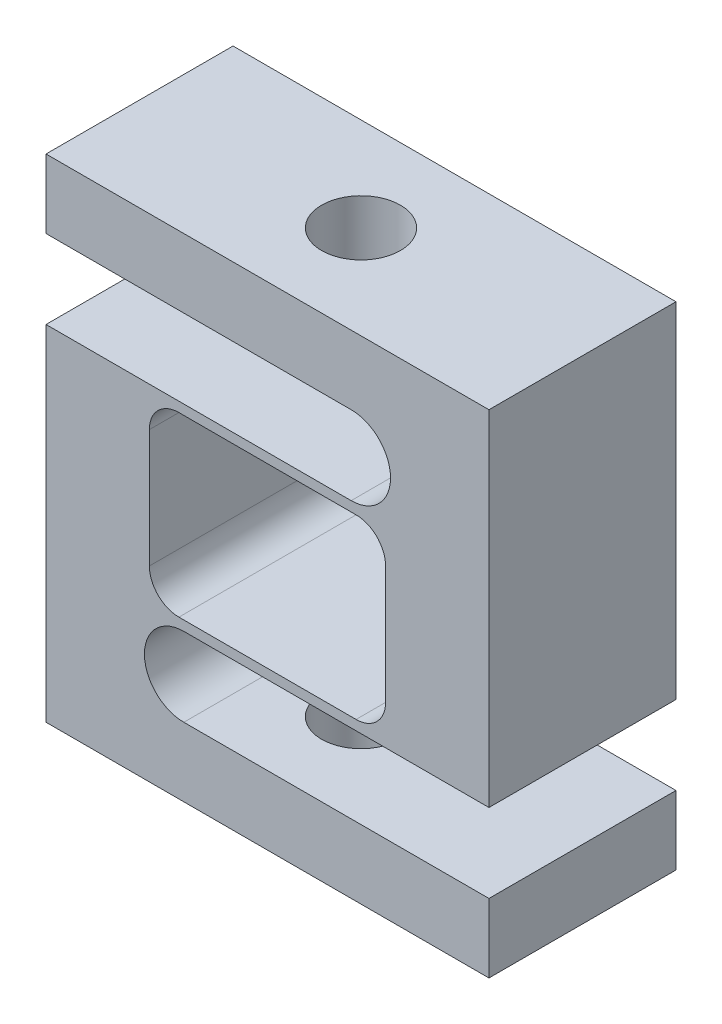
ISO-10303-21;
HEADER;
FILE_DESCRIPTION(('STEP AP214'),'2;1');
FILE_NAME('part.step','',(''),(''),'','','');
FILE_SCHEMA(('AUTOMOTIVE_DESIGN { 1 0 10303 214 1 1 1 1 }'));
ENDSEC;
DATA;
#1=APPLICATION_CONTEXT('core data for automotive mechanical design processes');
#2=APPLICATION_PROTOCOL_DEFINITION('international standard','automotive_design',2000,#1);
#3=PRODUCT_CONTEXT('',#1,'mechanical');
#4=PRODUCT('Part','Part','',(#3));
#5=PRODUCT_RELATED_PRODUCT_CATEGORY('part','',(#4));
#6=PRODUCT_DEFINITION_FORMATION('','',#4);
#7=PRODUCT_DEFINITION_CONTEXT('part definition',#1,'design');
#8=PRODUCT_DEFINITION('design','',#6,#7);
#9=PRODUCT_DEFINITION_SHAPE('','',#8);
#10=(LENGTH_UNIT() NAMED_UNIT(*) SI_UNIT(.MILLI.,.METRE.));
#11=(NAMED_UNIT(*) PLANE_ANGLE_UNIT() SI_UNIT($,.RADIAN.));
#12=(NAMED_UNIT(*) SI_UNIT($,.STERADIAN.) SOLID_ANGLE_UNIT());
#13=UNCERTAINTY_MEASURE_WITH_UNIT(LENGTH_MEASURE(1.E-05),#10,'distance_accuracy_value','');
#14=(GEOMETRIC_REPRESENTATION_CONTEXT(3) GLOBAL_UNCERTAINTY_ASSIGNED_CONTEXT((#13)) GLOBAL_UNIT_ASSIGNED_CONTEXT((#10,
#11,#12)) REPRESENTATION_CONTEXT('',''));
#15=CARTESIAN_POINT('',(0.,0.,0.));
#16=DIRECTION('',(0.,0.,1.));
#17=DIRECTION('',(1.,0.,0.));
#18=AXIS2_PLACEMENT_3D('',#15,#16,#17);
#19=CARTESIAN_POINT('',(8.5,14.,9.5));
#20=DIRECTION('',(0.,0.,-1.));
#21=DIRECTION('',(-1.,0.,0.));
#22=AXIS2_PLACEMENT_3D('',#19,#20,#21);
#23=PLANE('',#22);
#24=DIRECTION('',(0.,-1.,0.));
#25=VECTOR('',#24,1.);
#26=CARTESIAN_POINT('',(-22.5,25.,9.5));
#27=LINE('',#26,#25);
#28=CARTESIAN_POINT('',(-22.5,25.,9.5));
#29=VERTEX_POINT('',#28);
#30=CARTESIAN_POINT('',(-22.5,18.,9.5));
#31=VERTEX_POINT('',#30);
#32=EDGE_CURVE('E189',#29,#31,#27,.T.);
#33=ORIENTED_EDGE('',*,*,#32,.T.);
#34=DIRECTION('',(1.,0.,0.));
#35=VECTOR('',#34,1.);
#36=CARTESIAN_POINT('',(-22.5,18.,9.5));
#37=LINE('',#36,#35);
#38=CARTESIAN_POINT('',(8.5,18.,9.5));
#39=VERTEX_POINT('',#38);
#40=EDGE_CURVE('E178',#31,#39,#37,.T.);
#41=ORIENTED_EDGE('',*,*,#40,.T.);
#42=CARTESIAN_POINT('',(8.5,14.,9.5));
#43=DIRECTION('',(0.,0.,-1.));
#44=DIRECTION('',(-1.,0.,0.));
#45=AXIS2_PLACEMENT_3D('',#42,#43,#44);
#46=CIRCLE('',#45,4.);
#47=CARTESIAN_POINT('',(8.5,10.,9.5));
#48=VERTEX_POINT('',#47);
#49=EDGE_CURVE('E188',#39,#48,#46,.T.);
#50=ORIENTED_EDGE('',*,*,#49,.T.);
#51=DIRECTION('',(-1.,0.,0.));
#52=VECTOR('',#51,1.);
#53=CARTESIAN_POINT('',(8.5,10.,9.5));
#54=LINE('',#53,#52);
#55=CARTESIAN_POINT('',(-22.5,10.,9.5));
#56=VERTEX_POINT('',#55);
#57=EDGE_CURVE('E279',#48,#56,#54,.T.);
#58=ORIENTED_EDGE('',*,*,#57,.T.);
#59=DIRECTION('',(0.,-1.,0.));
#60=VECTOR('',#59,1.);
#61=CARTESIAN_POINT('',(-22.5,10.,9.5));
#62=LINE('',#61,#60);
#63=CARTESIAN_POINT('',(-22.5,-25.,9.5));
#64=VERTEX_POINT('',#63);
#65=EDGE_CURVE('E281',#56,#64,#62,.T.);
#66=ORIENTED_EDGE('',*,*,#65,.T.);
#67=DIRECTION('',(1.,0.,0.));
#68=VECTOR('',#67,1.);
#69=CARTESIAN_POINT('',(-22.5,-25.,9.5));
#70=LINE('',#69,#68);
#71=CARTESIAN_POINT('',(22.5,-25.,9.5));
#72=VERTEX_POINT('',#71);
#73=EDGE_CURVE('E283',#64,#72,#70,.T.);
#74=ORIENTED_EDGE('',*,*,#73,.T.);
#75=DIRECTION('',(0.,1.,0.));
#76=VECTOR('',#75,1.);
#77=CARTESIAN_POINT('',(22.5,-18.,9.5));
#78=LINE('',#77,#76);
#79=CARTESIAN_POINT('',(22.5,-18.,9.5));
#80=VERTEX_POINT('',#79);
#81=EDGE_CURVE('E285',#72,#80,#78,.T.);
#82=ORIENTED_EDGE('',*,*,#81,.T.);
#83=DIRECTION('',(-1.,0.,0.));
#84=VECTOR('',#83,1.);
#85=CARTESIAN_POINT('',(-8.49999999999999,-18.,9.5));
#86=LINE('',#85,#84);
#87=CARTESIAN_POINT('',(-8.49999999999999,-18.,9.5));
#88=VERTEX_POINT('',#87);
#89=EDGE_CURVE('E287',#80,#88,#86,.T.);
#90=ORIENTED_EDGE('',*,*,#89,.T.);
#91=CARTESIAN_POINT('',(-8.49999999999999,-14.,9.5));
#92=DIRECTION('',(0.,0.,-1.));
#93=DIRECTION('',(1.,0.,0.));
#94=AXIS2_PLACEMENT_3D('',#91,#92,#93);
#95=CIRCLE('',#94,4.);
#96=CARTESIAN_POINT('',(-8.49999999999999,-10.,9.5));
#97=VERTEX_POINT('',#96);
#98=EDGE_CURVE('E289',#88,#97,#95,.T.);
#99=ORIENTED_EDGE('',*,*,#98,.T.);
#100=DIRECTION('',(1.,0.,0.));
#101=VECTOR('',#100,1.);
#102=CARTESIAN_POINT('',(22.5,-10.,9.5));
#103=LINE('',#102,#101);
#104=CARTESIAN_POINT('',(22.5,-10.,9.5));
#105=VERTEX_POINT('',#104);
#106=EDGE_CURVE('E291',#97,#105,#103,.T.);
#107=ORIENTED_EDGE('',*,*,#106,.T.);
#108=DIRECTION('',(0.,1.,0.));
#109=VECTOR('',#108,1.);
#110=CARTESIAN_POINT('',(22.5,25.,9.5));
#111=LINE('',#110,#109);
#112=CARTESIAN_POINT('',(22.5,25.,9.5));
#113=VERTEX_POINT('',#112);
#114=EDGE_CURVE('E293',#105,#113,#111,.T.);
#115=ORIENTED_EDGE('',*,*,#114,.T.);
#116=DIRECTION('',(-1.,0.,0.));
#117=VECTOR('',#116,1.);
#118=CARTESIAN_POINT('',(-22.5,25.,9.5));
#119=LINE('',#118,#117);
#120=EDGE_CURVE('E193',#113,#29,#119,.T.);
#121=ORIENTED_EDGE('',*,*,#120,.T.);
#122=EDGE_LOOP('',(#33,#41,#50,#58,#66,#74,#82,#90,#99,#107,#115,#121));
#123=FACE_BOUND('',#122,.T.);
#124=DIRECTION('',(0.,-1.,0.));
#125=VECTOR('',#124,1.);
#126=CARTESIAN_POINT('',(-12.,9.,9.5));
#127=LINE('',#126,#125);
#128=CARTESIAN_POINT('',(-12.,6.,9.5));
#129=VERTEX_POINT('',#128);
#130=CARTESIAN_POINT('',(-12.,-6.,9.5));
#131=VERTEX_POINT('',#130);
#132=EDGE_CURVE('E257',#129,#131,#127,.T.);
#133=ORIENTED_EDGE('',*,*,#132,.F.);
#134=CARTESIAN_POINT('',(-9.,6.,9.5));
#135=DIRECTION('',(0.,0.,-1.));
#136=DIRECTION('',(-1.,0.,0.));
#137=AXIS2_PLACEMENT_3D('',#134,#135,#136);
#138=CIRCLE('',#137,3.);
#139=CARTESIAN_POINT('',(-9.,9.,9.5));
#140=VERTEX_POINT('',#139);
#141=EDGE_CURVE('E228',#129,#140,#138,.T.);
#142=ORIENTED_EDGE('',*,*,#141,.T.);
#143=DIRECTION('',(-1.,0.,0.));
#144=VECTOR('',#143,1.);
#145=CARTESIAN_POINT('',(-12.,9.,9.5));
#146=LINE('',#145,#144);
#147=CARTESIAN_POINT('',(9.,9.,9.5));
#148=VERTEX_POINT('',#147);
#149=EDGE_CURVE('E259',#148,#140,#146,.T.);
#150=ORIENTED_EDGE('',*,*,#149,.F.);
#151=CARTESIAN_POINT('',(9.,6.,9.5));
#152=DIRECTION('',(0.,0.,-1.));
#153=DIRECTION('',(-1.,0.,0.));
#154=AXIS2_PLACEMENT_3D('',#151,#152,#153);
#155=CIRCLE('',#154,3.);
#156=CARTESIAN_POINT('',(12.,6.,9.5));
#157=VERTEX_POINT('',#156);
#158=EDGE_CURVE('E232',#148,#157,#155,.T.);
#159=ORIENTED_EDGE('',*,*,#158,.T.);
#160=DIRECTION('',(0.,1.,0.));
#161=VECTOR('',#160,1.);
#162=CARTESIAN_POINT('',(12.,9.,9.5));
#163=LINE('',#162,#161);
#164=CARTESIAN_POINT('',(12.,-6.,9.5));
#165=VERTEX_POINT('',#164);
#166=EDGE_CURVE('E256',#165,#157,#163,.T.);
#167=ORIENTED_EDGE('',*,*,#166,.F.);
#168=CARTESIAN_POINT('',(9.00000000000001,-6.,9.5));
#169=DIRECTION('',(0.,0.,-1.));
#170=DIRECTION('',(-1.,0.,0.));
#171=AXIS2_PLACEMENT_3D('',#168,#169,#170);
#172=CIRCLE('',#171,3.);
#173=CARTESIAN_POINT('',(9.00000000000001,-9.,9.5));
#174=VERTEX_POINT('',#173);
#175=EDGE_CURVE('E12',#165,#174,#172,.T.);
#176=ORIENTED_EDGE('',*,*,#175,.T.);
#177=DIRECTION('',(1.,0.,0.));
#178=VECTOR('',#177,1.);
#179=CARTESIAN_POINT('',(-12.,-9.,9.5));
#180=LINE('',#179,#178);
#181=CARTESIAN_POINT('',(-9.,-9.,9.5));
#182=VERTEX_POINT('',#181);
#183=EDGE_CURVE('E254',#182,#174,#180,.T.);
#184=ORIENTED_EDGE('',*,*,#183,.F.);
#185=CARTESIAN_POINT('',(-9.,-6.,9.5));
#186=DIRECTION('',(0.,0.,-1.));
#187=DIRECTION('',(-1.,0.,0.));
#188=AXIS2_PLACEMENT_3D('',#185,#186,#187);
#189=CIRCLE('',#188,3.);
#190=EDGE_CURVE('E236',#182,#131,#189,.T.);
#191=ORIENTED_EDGE('',*,*,#190,.T.);
#192=EDGE_LOOP('',(#133,#142,#150,#159,#167,#176,#184,#191));
#193=FACE_BOUND('',#192,.T.);
#194=ADVANCED_FACE('F41',(#123,#193),#23,.F.);
#195=CARTESIAN_POINT('',(8.5,14.,-9.5));
#196=DIRECTION('',(0.,0.,-1.));
#197=DIRECTION('',(-1.,0.,0.));
#198=AXIS2_PLACEMENT_3D('',#195,#196,#197);
#199=PLANE('',#198);
#200=DIRECTION('',(0.,-1.,0.));
#201=VECTOR('',#200,1.);
#202=CARTESIAN_POINT('',(-22.5,25.,-9.5));
#203=LINE('',#202,#201);
#204=CARTESIAN_POINT('',(-22.5,25.,-9.5));
#205=VERTEX_POINT('',#204);
#206=CARTESIAN_POINT('',(-22.5,18.,-9.5));
#207=VERTEX_POINT('',#206);
#208=EDGE_CURVE('E201',#205,#207,#203,.T.);
#209=ORIENTED_EDGE('',*,*,#208,.F.);
#210=DIRECTION('',(-1.,0.,0.));
#211=VECTOR('',#210,1.);
#212=CARTESIAN_POINT('',(-22.5,25.,-9.5));
#213=LINE('',#212,#211);
#214=CARTESIAN_POINT('',(22.5,25.,-9.5));
#215=VERTEX_POINT('',#214);
#216=EDGE_CURVE('E198',#215,#205,#213,.T.);
#217=ORIENTED_EDGE('',*,*,#216,.F.);
#218=DIRECTION('',(0.,1.,0.));
#219=VECTOR('',#218,1.);
#220=CARTESIAN_POINT('',(22.5,25.,-9.5));
#221=LINE('',#220,#219);
#222=CARTESIAN_POINT('',(22.5,-10.,-9.5));
#223=VERTEX_POINT('',#222);
#224=EDGE_CURVE('E316',#223,#215,#221,.T.);
#225=ORIENTED_EDGE('',*,*,#224,.F.);
#226=DIRECTION('',(1.,0.,0.));
#227=VECTOR('',#226,1.);
#228=CARTESIAN_POINT('',(22.5,-10.,-9.5));
#229=LINE('',#228,#227);
#230=CARTESIAN_POINT('',(-8.49999999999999,-10.,-9.5));
#231=VERTEX_POINT('',#230);
#232=EDGE_CURVE('E314',#231,#223,#229,.T.);
#233=ORIENTED_EDGE('',*,*,#232,.F.);
#234=CARTESIAN_POINT('',(-8.49999999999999,-14.,-9.5));
#235=DIRECTION('',(0.,0.,-1.));
#236=DIRECTION('',(1.,0.,0.));
#237=AXIS2_PLACEMENT_3D('',#234,#235,#236);
#238=CIRCLE('',#237,4.);
#239=CARTESIAN_POINT('',(-8.49999999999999,-18.,-9.5));
#240=VERTEX_POINT('',#239);
#241=EDGE_CURVE('E312',#240,#231,#238,.T.);
#242=ORIENTED_EDGE('',*,*,#241,.F.);
#243=DIRECTION('',(-1.,0.,0.));
#244=VECTOR('',#243,1.);
#245=CARTESIAN_POINT('',(-8.49999999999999,-18.,-9.5));
#246=LINE('',#245,#244);
#247=CARTESIAN_POINT('',(22.5,-18.,-9.5));
#248=VERTEX_POINT('',#247);
#249=EDGE_CURVE('E310',#248,#240,#246,.T.);
#250=ORIENTED_EDGE('',*,*,#249,.F.);
#251=DIRECTION('',(0.,1.,0.));
#252=VECTOR('',#251,1.);
#253=CARTESIAN_POINT('',(22.5,-18.,-9.5));
#254=LINE('',#253,#252);
#255=CARTESIAN_POINT('',(22.5,-25.,-9.5));
#256=VERTEX_POINT('',#255);
#257=EDGE_CURVE('E308',#256,#248,#254,.T.);
#258=ORIENTED_EDGE('',*,*,#257,.F.);
#259=DIRECTION('',(1.,0.,0.));
#260=VECTOR('',#259,1.);
#261=CARTESIAN_POINT('',(-22.5,-25.,-9.5));
#262=LINE('',#261,#260);
#263=CARTESIAN_POINT('',(-22.5,-25.,-9.5));
#264=VERTEX_POINT('',#263);
#265=EDGE_CURVE('E306',#264,#256,#262,.T.);
#266=ORIENTED_EDGE('',*,*,#265,.F.);
#267=DIRECTION('',(0.,-1.,0.));
#268=VECTOR('',#267,1.);
#269=CARTESIAN_POINT('',(-22.5,10.,-9.5));
#270=LINE('',#269,#268);
#271=CARTESIAN_POINT('',(-22.5,10.,-9.5));
#272=VERTEX_POINT('',#271);
#273=EDGE_CURVE('E304',#272,#264,#270,.T.);
#274=ORIENTED_EDGE('',*,*,#273,.F.);
#275=DIRECTION('',(-1.,0.,0.));
#276=VECTOR('',#275,1.);
#277=CARTESIAN_POINT('',(8.5,10.,-9.5));
#278=LINE('',#277,#276);
#279=CARTESIAN_POINT('',(8.5,10.,-9.5));
#280=VERTEX_POINT('',#279);
#281=EDGE_CURVE('E302',#280,#272,#278,.T.);
#282=ORIENTED_EDGE('',*,*,#281,.F.);
#283=CARTESIAN_POINT('',(8.5,14.,-9.5));
#284=DIRECTION('',(0.,0.,-1.));
#285=DIRECTION('',(-1.,0.,0.));
#286=AXIS2_PLACEMENT_3D('',#283,#284,#285);
#287=CIRCLE('',#286,4.);
#288=CARTESIAN_POINT('',(8.5,18.,-9.5));
#289=VERTEX_POINT('',#288);
#290=EDGE_CURVE('E300',#289,#280,#287,.T.);
#291=ORIENTED_EDGE('',*,*,#290,.F.);
#292=DIRECTION('',(1.,0.,0.));
#293=VECTOR('',#292,1.);
#294=CARTESIAN_POINT('',(-22.5,18.,-9.5));
#295=LINE('',#294,#293);
#296=EDGE_CURVE('E298',#207,#289,#295,.T.);
#297=ORIENTED_EDGE('',*,*,#296,.F.);
#298=EDGE_LOOP('',(#209,#217,#225,#233,#242,#250,#258,#266,#274,#282,#291,#297));
#299=FACE_BOUND('',#298,.T.);
#300=DIRECTION('',(0.,1.,0.));
#301=VECTOR('',#300,1.);
#302=CARTESIAN_POINT('',(12.,9.,-9.5));
#303=LINE('',#302,#301);
#304=CARTESIAN_POINT('',(12.,-6.,-9.5));
#305=VERTEX_POINT('',#304);
#306=CARTESIAN_POINT('',(12.,6.,-9.5));
#307=VERTEX_POINT('',#306);
#308=EDGE_CURVE('E242',#305,#307,#303,.T.);
#309=ORIENTED_EDGE('',*,*,#308,.T.);
#310=CARTESIAN_POINT('',(9.,6.,-9.5));
#311=DIRECTION('',(0.,0.,-1.));
#312=DIRECTION('',(-1.,0.,0.));
#313=AXIS2_PLACEMENT_3D('',#310,#311,#312);
#314=CIRCLE('',#313,3.);
#315=CARTESIAN_POINT('',(9.,9.,-9.5));
#316=VERTEX_POINT('',#315);
#317=EDGE_CURVE('E230',#307,#316,#314,.F.);
#318=ORIENTED_EDGE('',*,*,#317,.T.);
#319=DIRECTION('',(-1.,0.,0.));
#320=VECTOR('',#319,1.);
#321=CARTESIAN_POINT('',(-12.,9.,-9.5));
#322=LINE('',#321,#320);
#323=CARTESIAN_POINT('',(-9.,9.,-9.5));
#324=VERTEX_POINT('',#323);
#325=EDGE_CURVE('E251',#316,#324,#322,.T.);
#326=ORIENTED_EDGE('',*,*,#325,.T.);
#327=CARTESIAN_POINT('',(-9.,6.,-9.5));
#328=DIRECTION('',(0.,0.,-1.));
#329=DIRECTION('',(-1.,0.,0.));
#330=AXIS2_PLACEMENT_3D('',#327,#328,#329);
#331=CIRCLE('',#330,3.);
#332=CARTESIAN_POINT('',(-12.,6.,-9.5));
#333=VERTEX_POINT('',#332);
#334=EDGE_CURVE('E226',#324,#333,#331,.F.);
#335=ORIENTED_EDGE('',*,*,#334,.T.);
#336=DIRECTION('',(0.,-1.,0.));
#337=VECTOR('',#336,1.);
#338=CARTESIAN_POINT('',(-12.,9.,-9.5));
#339=LINE('',#338,#337);
#340=CARTESIAN_POINT('',(-12.,-6.,-9.5));
#341=VERTEX_POINT('',#340);
#342=EDGE_CURVE('E267',#333,#341,#339,.T.);
#343=ORIENTED_EDGE('',*,*,#342,.T.);
#344=CARTESIAN_POINT('',(-9.,-6.,-9.5));
#345=DIRECTION('',(0.,0.,-1.));
#346=DIRECTION('',(-1.,0.,0.));
#347=AXIS2_PLACEMENT_3D('',#344,#345,#346);
#348=CIRCLE('',#347,3.);
#349=CARTESIAN_POINT('',(-9.,-9.,-9.5));
#350=VERTEX_POINT('',#349);
#351=EDGE_CURVE('E234',#341,#350,#348,.F.);
#352=ORIENTED_EDGE('',*,*,#351,.T.);
#353=DIRECTION('',(1.,0.,0.));
#354=VECTOR('',#353,1.);
#355=CARTESIAN_POINT('',(-12.,-9.,-9.5));
#356=LINE('',#355,#354);
#357=CARTESIAN_POINT('',(9.00000000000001,-9.,-9.5));
#358=VERTEX_POINT('',#357);
#359=EDGE_CURVE('E243',#350,#358,#356,.T.);
#360=ORIENTED_EDGE('',*,*,#359,.T.);
#361=CARTESIAN_POINT('',(9.00000000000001,-6.,-9.5));
#362=DIRECTION('',(0.,0.,-1.));
#363=DIRECTION('',(-1.,0.,0.));
#364=AXIS2_PLACEMENT_3D('',#361,#362,#363);
#365=CIRCLE('',#364,3.);
#366=EDGE_CURVE('E49',#358,#305,#365,.F.);
#367=ORIENTED_EDGE('',*,*,#366,.T.);
#368=EDGE_LOOP('',(#309,#318,#326,#335,#343,#352,#360,#367));
#369=FACE_BOUND('',#368,.T.);
#370=ADVANCED_FACE('F241',(#299,#369),#199,.T.);
#371=CARTESIAN_POINT('',(-22.5,25.,9.5));
#372=DIRECTION('',(1.,0.,0.));
#373=DIRECTION('',(0.,0.,-1.));
#374=AXIS2_PLACEMENT_3D('',#371,#372,#373);
#375=PLANE('',#374);
#376=ORIENTED_EDGE('',*,*,#208,.T.);
#377=DIRECTION('',(0.,0.,-1.));
#378=VECTOR('',#377,1.);
#379=CARTESIAN_POINT('',(-22.5,18.,9.5));
#380=LINE('',#379,#378);
#381=EDGE_CURVE('E182',#31,#207,#380,.T.);
#382=ORIENTED_EDGE('',*,*,#381,.F.);
#383=ORIENTED_EDGE('',*,*,#32,.F.);
#384=DIRECTION('',(0.,0.,-1.));
#385=VECTOR('',#384,1.);
#386=CARTESIAN_POINT('',(-22.5,25.,9.5));
#387=LINE('',#386,#385);
#388=EDGE_CURVE('E296',#29,#205,#387,.T.);
#389=ORIENTED_EDGE('',*,*,#388,.T.);
#390=EDGE_LOOP('',(#376,#382,#383,#389));
#391=FACE_BOUND('',#390,.T.);
#392=ADVANCED_FACE('F199',(#391),#375,.F.);
#393=CARTESIAN_POINT('',(-22.5,18.,9.5));
#394=DIRECTION('',(0.,1.,0.));
#395=DIRECTION('',(-1.,0.,0.));
#396=AXIS2_PLACEMENT_3D('',#393,#394,#395);
#397=PLANE('',#396);
#398=CARTESIAN_POINT('',(0.,18.,0.));
#399=DIRECTION('',(0.,1.,0.));
#400=DIRECTION('',(-1.,0.,0.));
#401=AXIS2_PLACEMENT_3D('',#398,#399,#400);
#402=CIRCLE('',#401,4.);
#403=CARTESIAN_POINT('',(-4.,18.,0.));
#404=VERTEX_POINT('',#403);
#405=EDGE_CURVE('E270',#404,#404,#402,.F.);
#406=ORIENTED_EDGE('',*,*,#405,.F.);
#407=EDGE_LOOP('',(#406));
#408=FACE_BOUND('',#407,.T.);
#409=ORIENTED_EDGE('',*,*,#296,.T.);
#410=DIRECTION('',(0.,0.,-1.));
#411=VECTOR('',#410,1.);
#412=CARTESIAN_POINT('',(8.5,18.,9.5));
#413=LINE('',#412,#411);
#414=EDGE_CURVE('E185',#39,#289,#413,.T.);
#415=ORIENTED_EDGE('',*,*,#414,.F.);
#416=ORIENTED_EDGE('',*,*,#40,.F.);
#417=ORIENTED_EDGE('',*,*,#381,.T.);
#418=EDGE_LOOP('',(#409,#415,#416,#417));
#419=FACE_BOUND('',#418,.T.);
#420=ADVANCED_FACE('F180',(#408,#419),#397,.F.);
#421=CARTESIAN_POINT('',(8.5,14.,9.5));
#422=DIRECTION('',(0.,0.,-1.));
#423=DIRECTION('',(-1.,0.,0.));
#424=AXIS2_PLACEMENT_3D('',#421,#422,#423);
#425=CYLINDRICAL_SURFACE('',#424,4.);
#426=ORIENTED_EDGE('',*,*,#290,.T.);
#427=DIRECTION('',(0.,0.,-1.));
#428=VECTOR('',#427,1.);
#429=CARTESIAN_POINT('',(8.5,10.,9.5));
#430=LINE('',#429,#428);
#431=EDGE_CURVE('E206',#48,#280,#430,.T.);
#432=ORIENTED_EDGE('',*,*,#431,.F.);
#433=ORIENTED_EDGE('',*,*,#49,.F.);
#434=ORIENTED_EDGE('',*,*,#414,.T.);
#435=EDGE_LOOP('',(#426,#432,#433,#434));
#436=FACE_BOUND('',#435,.T.);
#437=ADVANCED_FACE('F366',(#436),#425,.F.);
#438=CARTESIAN_POINT('',(8.5,10.,9.5));
#439=DIRECTION('',(0.,-1.,0.));
#440=DIRECTION('',(1.,0.,0.));
#441=AXIS2_PLACEMENT_3D('',#438,#439,#440);
#442=PLANE('',#441);
#443=ORIENTED_EDGE('',*,*,#281,.T.);
#444=DIRECTION('',(0.,0.,-1.));
#445=VECTOR('',#444,1.);
#446=CARTESIAN_POINT('',(-22.5,10.,9.5));
#447=LINE('',#446,#445);
#448=EDGE_CURVE('E341',#56,#272,#447,.T.);
#449=ORIENTED_EDGE('',*,*,#448,.F.);
#450=ORIENTED_EDGE('',*,*,#57,.F.);
#451=ORIENTED_EDGE('',*,*,#431,.T.);
#452=EDGE_LOOP('',(#443,#449,#450,#451));
#453=FACE_BOUND('',#452,.T.);
#454=ADVANCED_FACE('F348',(#453),#442,.F.);
#455=CARTESIAN_POINT('',(-22.5,10.,9.5));
#456=DIRECTION('',(1.,0.,0.));
#457=DIRECTION('',(0.,1.,0.));
#458=AXIS2_PLACEMENT_3D('',#455,#456,#457);
#459=PLANE('',#458);
#460=ORIENTED_EDGE('',*,*,#273,.T.);
#461=DIRECTION('',(0.,0.,-1.));
#462=VECTOR('',#461,1.);
#463=CARTESIAN_POINT('',(-22.5,-25.,9.5));
#464=LINE('',#463,#462);
#465=EDGE_CURVE('E338',#64,#264,#464,.T.);
#466=ORIENTED_EDGE('',*,*,#465,.F.);
#467=ORIENTED_EDGE('',*,*,#65,.F.);
#468=ORIENTED_EDGE('',*,*,#448,.T.);
#469=EDGE_LOOP('',(#460,#466,#467,#468));
#470=FACE_BOUND('',#469,.T.);
#471=ADVANCED_FACE('F358',(#470),#459,.F.);
#472=CARTESIAN_POINT('',(-22.5,-25.,9.5));
#473=DIRECTION('',(0.,1.,0.));
#474=DIRECTION('',(-1.,0.,0.));
#475=AXIS2_PLACEMENT_3D('',#472,#473,#474);
#476=PLANE('',#475);
#477=CARTESIAN_POINT('',(0.,-25.,0.));
#478=DIRECTION('',(0.,-1.,0.));
#479=DIRECTION('',(1.,0.,0.));
#480=AXIS2_PLACEMENT_3D('',#477,#478,#479);
#481=CIRCLE('',#480,4.);
#482=CARTESIAN_POINT('',(4.,-25.,0.));
#483=VERTEX_POINT('',#482);
#484=EDGE_CURVE('E599',#483,#483,#481,.T.);
#485=ORIENTED_EDGE('',*,*,#484,.F.);
#486=EDGE_LOOP('',(#485));
#487=FACE_BOUND('',#486,.T.);
#488=ORIENTED_EDGE('',*,*,#265,.T.);
#489=DIRECTION('',(0.,0.,-1.));
#490=VECTOR('',#489,1.);
#491=CARTESIAN_POINT('',(22.5,-25.,9.5));
#492=LINE('',#491,#490);
#493=EDGE_CURVE('E335',#72,#256,#492,.T.);
#494=ORIENTED_EDGE('',*,*,#493,.F.);
#495=ORIENTED_EDGE('',*,*,#73,.F.);
#496=ORIENTED_EDGE('',*,*,#465,.T.);
#497=EDGE_LOOP('',(#488,#494,#495,#496));
#498=FACE_BOUND('',#497,.T.);
#499=ADVANCED_FACE('F362',(#487,#498),#476,.F.);
#500=CARTESIAN_POINT('',(22.5,-18.,9.5));
#501=DIRECTION('',(-1.,0.,0.));
#502=DIRECTION('',(0.,-1.,0.));
#503=AXIS2_PLACEMENT_3D('',#500,#501,#502);
#504=PLANE('',#503);
#505=ORIENTED_EDGE('',*,*,#257,.T.);
#506=DIRECTION('',(0.,0.,-1.));
#507=VECTOR('',#506,1.);
#508=CARTESIAN_POINT('',(22.5,-18.,9.5));
#509=LINE('',#508,#507);
#510=EDGE_CURVE('E332',#80,#248,#509,.T.);
#511=ORIENTED_EDGE('',*,*,#510,.F.);
#512=ORIENTED_EDGE('',*,*,#81,.F.);
#513=ORIENTED_EDGE('',*,*,#493,.T.);
#514=EDGE_LOOP('',(#505,#511,#512,#513));
#515=FACE_BOUND('',#514,.T.);
#516=ADVANCED_FACE('F405',(#515),#504,.F.);
#517=CARTESIAN_POINT('',(-8.49999999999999,-18.,9.5));
#518=DIRECTION('',(0.,-1.,0.));
#519=DIRECTION('',(0.,0.,-1.));
#520=AXIS2_PLACEMENT_3D('',#517,#518,#519);
#521=PLANE('',#520);
#522=CARTESIAN_POINT('',(0.,-18.,0.));
#523=DIRECTION('',(0.,-1.,0.));
#524=DIRECTION('',(0.,0.,-1.));
#525=AXIS2_PLACEMENT_3D('',#522,#523,#524);
#526=CIRCLE('',#525,4.);
#527=CARTESIAN_POINT('',(0.,-18.,-4.));
#528=VERTEX_POINT('',#527);
#529=EDGE_CURVE('E602',#528,#528,#526,.F.);
#530=ORIENTED_EDGE('',*,*,#529,.F.);
#531=EDGE_LOOP('',(#530));
#532=FACE_BOUND('',#531,.T.);
#533=ORIENTED_EDGE('',*,*,#249,.T.);
#534=DIRECTION('',(0.,0.,-1.));
#535=VECTOR('',#534,1.);
#536=CARTESIAN_POINT('',(-8.49999999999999,-18.,9.5));
#537=LINE('',#536,#535);
#538=EDGE_CURVE('E329',#88,#240,#537,.T.);
#539=ORIENTED_EDGE('',*,*,#538,.F.);
#540=ORIENTED_EDGE('',*,*,#89,.F.);
#541=ORIENTED_EDGE('',*,*,#510,.T.);
#542=EDGE_LOOP('',(#533,#539,#540,#541));
#543=FACE_BOUND('',#542,.T.);
#544=ADVANCED_FACE('F401',(#532,#543),#521,.F.);
#545=CARTESIAN_POINT('',(-8.49999999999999,-14.,9.5));
#546=DIRECTION('',(0.,0.,-1.));
#547=DIRECTION('',(-1.,0.,0.));
#548=AXIS2_PLACEMENT_3D('',#545,#546,#547);
#549=CYLINDRICAL_SURFACE('',#548,4.);
#550=ORIENTED_EDGE('',*,*,#241,.T.);
#551=DIRECTION('',(0.,0.,-1.));
#552=VECTOR('',#551,1.);
#553=CARTESIAN_POINT('',(-8.49999999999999,-10.,9.5));
#554=LINE('',#553,#552);
#555=EDGE_CURVE('E326',#97,#231,#554,.T.);
#556=ORIENTED_EDGE('',*,*,#555,.F.);
#557=ORIENTED_EDGE('',*,*,#98,.F.);
#558=ORIENTED_EDGE('',*,*,#538,.T.);
#559=EDGE_LOOP('',(#550,#556,#557,#558));
#560=FACE_BOUND('',#559,.T.);
#561=ADVANCED_FACE('F397',(#560),#549,.F.);
#562=CARTESIAN_POINT('',(22.5,-10.,9.5));
#563=DIRECTION('',(0.,1.,0.));
#564=DIRECTION('',(-1.,0.,0.));
#565=AXIS2_PLACEMENT_3D('',#562,#563,#564);
#566=PLANE('',#565);
#567=ORIENTED_EDGE('',*,*,#232,.T.);
#568=DIRECTION('',(0.,0.,-1.));
#569=VECTOR('',#568,1.);
#570=CARTESIAN_POINT('',(22.5,-10.,9.5));
#571=LINE('',#570,#569);
#572=EDGE_CURVE('E323',#105,#223,#571,.T.);
#573=ORIENTED_EDGE('',*,*,#572,.F.);
#574=ORIENTED_EDGE('',*,*,#106,.F.);
#575=ORIENTED_EDGE('',*,*,#555,.T.);
#576=EDGE_LOOP('',(#567,#573,#574,#575));
#577=FACE_BOUND('',#576,.T.);
#578=ADVANCED_FACE('F393',(#577),#566,.F.);
#579=CARTESIAN_POINT('',(22.5,25.,9.5));
#580=DIRECTION('',(-1.,0.,0.));
#581=DIRECTION('',(0.,-1.,0.));
#582=AXIS2_PLACEMENT_3D('',#579,#580,#581);
#583=PLANE('',#582);
#584=ORIENTED_EDGE('',*,*,#224,.T.);
#585=DIRECTION('',(0.,0.,-1.));
#586=VECTOR('',#585,1.);
#587=CARTESIAN_POINT('',(22.5,25.,9.5));
#588=LINE('',#587,#586);
#589=EDGE_CURVE('E320',#113,#215,#588,.T.);
#590=ORIENTED_EDGE('',*,*,#589,.F.);
#591=ORIENTED_EDGE('',*,*,#114,.F.);
#592=ORIENTED_EDGE('',*,*,#572,.T.);
#593=EDGE_LOOP('',(#584,#590,#591,#592));
#594=FACE_BOUND('',#593,.T.);
#595=ADVANCED_FACE('F389',(#594),#583,.F.);
#596=CARTESIAN_POINT('',(-22.5,25.,9.5));
#597=DIRECTION('',(0.,-1.,0.));
#598=DIRECTION('',(1.,0.,0.));
#599=AXIS2_PLACEMENT_3D('',#596,#597,#598);
#600=PLANE('',#599);
#601=CARTESIAN_POINT('',(0.,25.,0.));
#602=DIRECTION('',(0.,1.,0.));
#603=DIRECTION('',(-1.,0.,0.));
#604=AXIS2_PLACEMENT_3D('',#601,#602,#603);
#605=CIRCLE('',#604,4.);
#606=CARTESIAN_POINT('',(-4.,25.,0.));
#607=VERTEX_POINT('',#606);
#608=EDGE_CURVE('E603',#607,#607,#605,.T.);
#609=ORIENTED_EDGE('',*,*,#608,.F.);
#610=EDGE_LOOP('',(#609));
#611=FACE_BOUND('',#610,.T.);
#612=ORIENTED_EDGE('',*,*,#216,.T.);
#613=ORIENTED_EDGE('',*,*,#388,.F.);
#614=ORIENTED_EDGE('',*,*,#120,.F.);
#615=ORIENTED_EDGE('',*,*,#589,.T.);
#616=EDGE_LOOP('',(#612,#613,#614,#615));
#617=FACE_BOUND('',#616,.T.);
#618=ADVANCED_FACE('F386',(#611,#617),#600,.F.);
#619=CARTESIAN_POINT('',(-12.,9.,9.5));
#620=DIRECTION('',(1.,0.,0.));
#621=DIRECTION('',(0.,1.,0.));
#622=AXIS2_PLACEMENT_3D('',#619,#620,#621);
#623=PLANE('',#622);
#624=ORIENTED_EDGE('',*,*,#342,.F.);
#625=DIRECTION('',(0.,0.,-1.));
#626=VECTOR('',#625,1.);
#627=CARTESIAN_POINT('',(-12.,6.,9.5));
#628=LINE('',#627,#626);
#629=EDGE_CURVE('E215',#333,#129,#628,.F.);
#630=ORIENTED_EDGE('',*,*,#629,.T.);
#631=ORIENTED_EDGE('',*,*,#132,.T.);
#632=DIRECTION('',(0.,0.,-1.));
#633=VECTOR('',#632,1.);
#634=CARTESIAN_POINT('',(-12.,-6.,-9.5));
#635=LINE('',#634,#633);
#636=EDGE_CURVE('E212',#131,#341,#635,.T.);
#637=ORIENTED_EDGE('',*,*,#636,.T.);
#638=EDGE_LOOP('',(#624,#630,#631,#637));
#639=FACE_BOUND('',#638,.T.);
#640=ADVANCED_FACE('F383',(#639),#623,.T.);
#641=CARTESIAN_POINT('',(-12.,-9.,9.5));
#642=DIRECTION('',(0.,1.,0.));
#643=DIRECTION('',(-1.,0.,0.));
#644=AXIS2_PLACEMENT_3D('',#641,#642,#643);
#645=PLANE('',#644);
#646=ORIENTED_EDGE('',*,*,#359,.F.);
#647=DIRECTION('',(0.,0.,-1.));
#648=VECTOR('',#647,1.);
#649=CARTESIAN_POINT('',(-9.,-9.,9.5));
#650=LINE('',#649,#648);
#651=EDGE_CURVE('E61',#350,#182,#650,.F.);
#652=ORIENTED_EDGE('',*,*,#651,.T.);
#653=ORIENTED_EDGE('',*,*,#183,.T.);
#654=DIRECTION('',(0.,0.,-1.));
#655=VECTOR('',#654,1.);
#656=CARTESIAN_POINT('',(9.00000000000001,-9.,-9.5));
#657=LINE('',#656,#655);
#658=EDGE_CURVE('E222',#174,#358,#657,.T.);
#659=ORIENTED_EDGE('',*,*,#658,.T.);
#660=EDGE_LOOP('',(#646,#652,#653,#659));
#661=FACE_BOUND('',#660,.T.);
#662=ADVANCED_FACE('F253',(#661),#645,.T.);
#663=CARTESIAN_POINT('',(12.,9.,9.5));
#664=DIRECTION('',(-1.,0.,0.));
#665=DIRECTION('',(0.,-1.,0.));
#666=AXIS2_PLACEMENT_3D('',#663,#664,#665);
#667=PLANE('',#666);
#668=ORIENTED_EDGE('',*,*,#166,.T.);
#669=DIRECTION('',(0.,0.,-1.));
#670=VECTOR('',#669,1.);
#671=CARTESIAN_POINT('',(12.,6.,-9.5));
#672=LINE('',#671,#670);
#673=EDGE_CURVE('E219',#157,#307,#672,.T.);
#674=ORIENTED_EDGE('',*,*,#673,.T.);
#675=ORIENTED_EDGE('',*,*,#308,.F.);
#676=DIRECTION('',(0.,0.,-1.));
#677=VECTOR('',#676,1.);
#678=CARTESIAN_POINT('',(12.,-6.,9.5));
#679=LINE('',#678,#677);
#680=EDGE_CURVE('E217',#305,#165,#679,.F.);
#681=ORIENTED_EDGE('',*,*,#680,.T.);
#682=EDGE_LOOP('',(#668,#674,#675,#681));
#683=FACE_BOUND('',#682,.T.);
#684=ADVANCED_FACE('F249',(#683),#667,.T.);
#685=CARTESIAN_POINT('',(-12.,9.,9.5));
#686=DIRECTION('',(0.,-1.,0.));
#687=DIRECTION('',(0.,0.,-1.));
#688=AXIS2_PLACEMENT_3D('',#685,#686,#687);
#689=PLANE('',#688);
#690=ORIENTED_EDGE('',*,*,#149,.T.);
#691=DIRECTION('',(0.,0.,-1.));
#692=VECTOR('',#691,1.);
#693=CARTESIAN_POINT('',(-9.,9.,-9.5));
#694=LINE('',#693,#692);
#695=EDGE_CURVE('E204',#140,#324,#694,.T.);
#696=ORIENTED_EDGE('',*,*,#695,.T.);
#697=ORIENTED_EDGE('',*,*,#325,.F.);
#698=DIRECTION('',(0.,0.,-1.));
#699=VECTOR('',#698,1.);
#700=CARTESIAN_POINT('',(9.,9.,9.5));
#701=LINE('',#700,#699);
#702=EDGE_CURVE('E202',#316,#148,#701,.F.);
#703=ORIENTED_EDGE('',*,*,#702,.T.);
#704=EDGE_LOOP('',(#690,#696,#697,#703));
#705=FACE_BOUND('',#704,.T.);
#706=ADVANCED_FACE('F467',(#705),#689,.T.);
#707=CARTESIAN_POINT('',(0.,-25.001,0.));
#708=DIRECTION('',(0.,1.,0.));
#709=DIRECTION('',(-1.,0.,0.));
#710=AXIS2_PLACEMENT_3D('',#707,#708,#709);
#711=CYLINDRICAL_SURFACE('',#710,4.);
#712=ORIENTED_EDGE('',*,*,#608,.T.);
#713=EDGE_LOOP('',(#712));
#714=FACE_BOUND('',#713,.T.);
#715=ORIENTED_EDGE('',*,*,#405,.T.);
#716=EDGE_LOOP('',(#715));
#717=FACE_BOUND('',#716,.T.);
#718=ADVANCED_FACE('F474',(#714,#717),#711,.F.);
#719=CARTESIAN_POINT('',(0.,25.001,0.));
#720=DIRECTION('',(0.,-1.,0.));
#721=DIRECTION('',(1.,0.,0.));
#722=AXIS2_PLACEMENT_3D('',#719,#720,#721);
#723=CYLINDRICAL_SURFACE('',#722,4.);
#724=ORIENTED_EDGE('',*,*,#484,.T.);
#725=EDGE_LOOP('',(#724));
#726=FACE_BOUND('',#725,.T.);
#727=ORIENTED_EDGE('',*,*,#529,.T.);
#728=EDGE_LOOP('',(#727));
#729=FACE_BOUND('',#728,.T.);
#730=ADVANCED_FACE('F483',(#726,#729),#723,.F.);
#731=CARTESIAN_POINT('',(-9.,6.,9.5));
#732=DIRECTION('',(0.,0.,1.));
#733=DIRECTION('',(1.,0.,0.));
#734=AXIS2_PLACEMENT_3D('',#731,#732,#733);
#735=CYLINDRICAL_SURFACE('',#734,3.);
#736=ORIENTED_EDGE('',*,*,#141,.F.);
#737=ORIENTED_EDGE('',*,*,#629,.F.);
#738=ORIENTED_EDGE('',*,*,#334,.F.);
#739=ORIENTED_EDGE('',*,*,#695,.F.);
#740=EDGE_LOOP('',(#736,#737,#738,#739));
#741=FACE_BOUND('',#740,.T.);
#742=ADVANCED_FACE('F488',(#741),#735,.F.);
#743=CARTESIAN_POINT('',(9.,6.,9.5));
#744=DIRECTION('',(0.,0.,1.));
#745=DIRECTION('',(1.,0.,0.));
#746=AXIS2_PLACEMENT_3D('',#743,#744,#745);
#747=CYLINDRICAL_SURFACE('',#746,3.);
#748=ORIENTED_EDGE('',*,*,#158,.F.);
#749=ORIENTED_EDGE('',*,*,#702,.F.);
#750=ORIENTED_EDGE('',*,*,#317,.F.);
#751=ORIENTED_EDGE('',*,*,#673,.F.);
#752=EDGE_LOOP('',(#748,#749,#750,#751));
#753=FACE_BOUND('',#752,.T.);
#754=ADVANCED_FACE('F495',(#753),#747,.F.);
#755=CARTESIAN_POINT('',(-9.,-6.,9.5));
#756=DIRECTION('',(0.,0.,1.));
#757=DIRECTION('',(1.,0.,0.));
#758=AXIS2_PLACEMENT_3D('',#755,#756,#757);
#759=CYLINDRICAL_SURFACE('',#758,3.);
#760=ORIENTED_EDGE('',*,*,#190,.F.);
#761=ORIENTED_EDGE('',*,*,#651,.F.);
#762=ORIENTED_EDGE('',*,*,#351,.F.);
#763=ORIENTED_EDGE('',*,*,#636,.F.);
#764=EDGE_LOOP('',(#760,#761,#762,#763));
#765=FACE_BOUND('',#764,.T.);
#766=ADVANCED_FACE('F503',(#765),#759,.F.);
#767=CARTESIAN_POINT('',(9.00000000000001,-6.,9.5));
#768=DIRECTION('',(0.,0.,1.));
#769=DIRECTION('',(1.,0.,0.));
#770=AXIS2_PLACEMENT_3D('',#767,#768,#769);
#771=CYLINDRICAL_SURFACE('',#770,3.);
#772=ORIENTED_EDGE('',*,*,#175,.F.);
#773=ORIENTED_EDGE('',*,*,#680,.F.);
#774=ORIENTED_EDGE('',*,*,#366,.F.);
#775=ORIENTED_EDGE('',*,*,#658,.F.);
#776=EDGE_LOOP('',(#772,#773,#774,#775));
#777=FACE_BOUND('',#776,.T.);
#778=ADVANCED_FACE('F43',(#777),#771,.F.);
#779=CLOSED_SHELL('',(#194,#370,#392,#420,#437,#454,#471,#499,#516,#544,#561,#578,#595,#618,
#640,#662,#684,#706,#718,#730,#742,#754,#766,#778));
#780=MANIFOLD_SOLID_BREP('B2',#779);
#781=ADVANCED_BREP_SHAPE_REPRESENTATION('',(#18,#780),#14);
#782=SHAPE_DEFINITION_REPRESENTATION(#9,#781);
ENDSEC;
END-ISO-10303-21;
